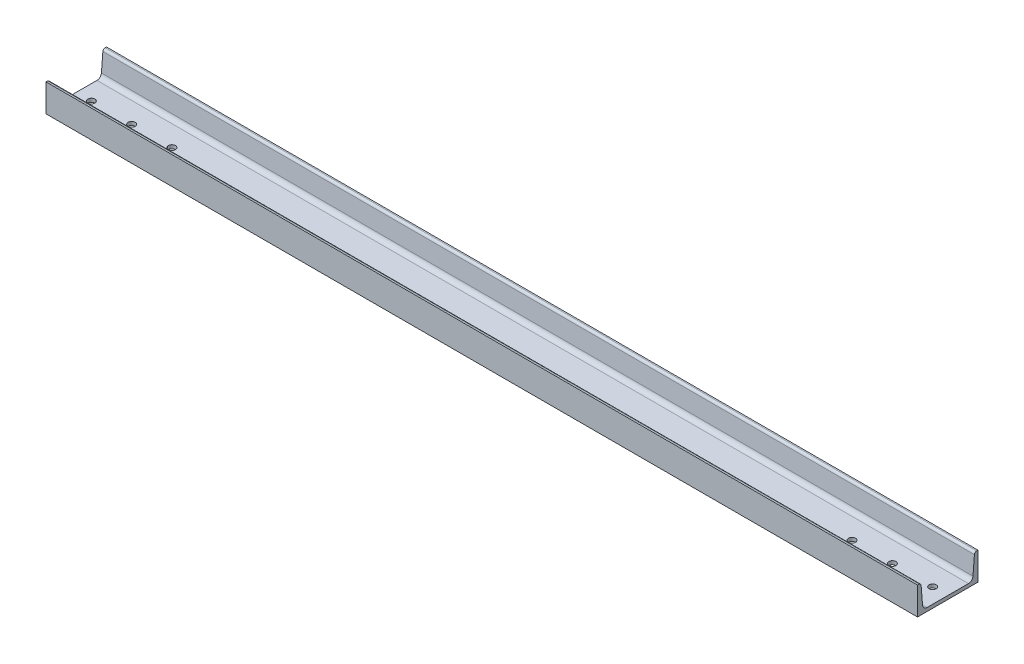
from build123d import *

# Parameters (mm, degrees)
BASE_EXTRUSION_DEPTH    = 865
ESQUISSE2_R             = 7
ENL_V_MAT_EXTRU_1_DEPTH = 869.821040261


with BuildPart() as part:
    # Esquisse1 → Base-Extrusion (new, symmetric)
    with BuildSketch(Plane(origin=(0, 0, 0), x_dir=(0, 0, -1), z_dir=(1, 0, 0))):
        with BuildLine():
            Line((-60, 0), (60, 0))
            Line((60, 0), (60, 55))
            Line((60, 55), (57.352768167, 55))
            ThreePointArc((57.352768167, 55), (54.300183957, 53.806316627), (52.867074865, 50.858546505))
            Line((52.867074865, 50.858546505), (50.02347403, 15.28290699))
            ThreePointArc((50.02347403, 15.28290699), (47.157255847, 9.387366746), (41.052087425, 7))
            Line((41.052087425, 7), (-41.052087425, 7))
            ThreePointArc((-41.052087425, 7), (-47.157255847, 9.387366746), (-50.02347403, 15.28290699))
            Line((-50.02347403, 15.28290699), (-52.867074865, 50.858546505))
            ThreePointArc((-52.867074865, 50.858546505), (-54.300183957, 53.806316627), (-57.352768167, 55))
            Line((-57.352768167, 55), (-60, 55))
            Line((-60, 55), (-60, 0))
        make_face()
    extrude(amount=BASE_EXTRUSION_DEPTH, both=True)

    # Esquisse2 → Enl_v. mat.-Extru.1 (cut, through all)
    with BuildSketch(Plane.XZ):
        with Locations(Location((835, 0, 0), (0, 0, 270))):
            Circle(ESQUISSE2_R)
        with Locations(Location((755, 0, 0), (0, 0, 270))):
            Circle(ESQUISSE2_R)
        with Locations(Location((675, 0, 0), (0, 0, 270))):
            Circle(ESQUISSE2_R)
    enl_v_mat_extru_1 = extrude(amount=-ENL_V_MAT_EXTRU_1_DEPTH, mode=Mode.SUBTRACT)

    # Sym_trie1: Enl_v. mat.-Extru.1 across plane
    add(enl_v_mat_extru_1.mirror(Plane(origin=(0, 0, 0), x_dir=(0, 0, 1), z_dir=(1, 0, 0))), mode=Mode.SUBTRACT)


solid = part.part
